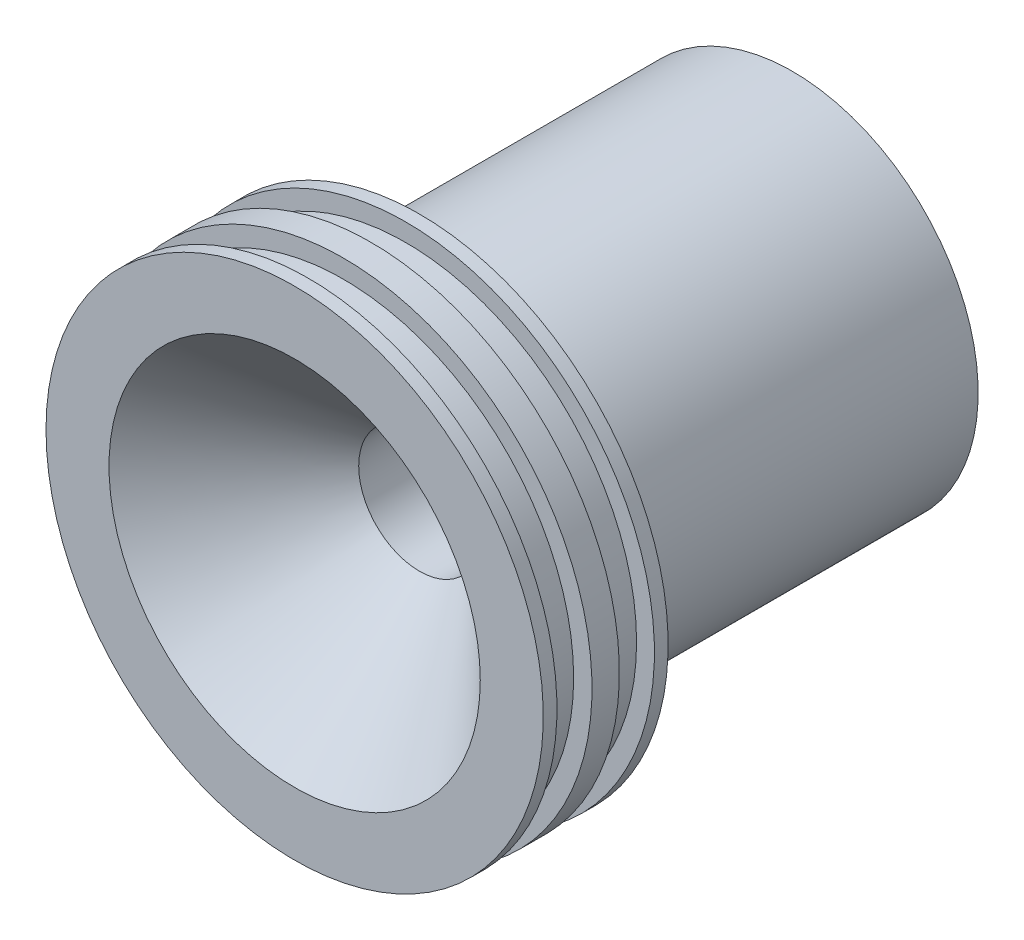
ISO-10303-21;
HEADER;
FILE_DESCRIPTION(('STEP AP214'),'2;1');
FILE_NAME('part.step','',(''),(''),'','','');
FILE_SCHEMA(('AUTOMOTIVE_DESIGN { 1 0 10303 214 1 1 1 1 }'));
ENDSEC;
DATA;
#1=APPLICATION_CONTEXT('core data for automotive mechanical design processes');
#2=APPLICATION_PROTOCOL_DEFINITION('international standard','automotive_design',2000,#1);
#3=PRODUCT_CONTEXT('',#1,'mechanical');
#4=PRODUCT('Part','Part','',(#3));
#5=PRODUCT_RELATED_PRODUCT_CATEGORY('part','',(#4));
#6=PRODUCT_DEFINITION_FORMATION('','',#4);
#7=PRODUCT_DEFINITION_CONTEXT('part definition',#1,'design');
#8=PRODUCT_DEFINITION('design','',#6,#7);
#9=PRODUCT_DEFINITION_SHAPE('','',#8);
#10=(LENGTH_UNIT() NAMED_UNIT(*) SI_UNIT(.MILLI.,.METRE.));
#11=(NAMED_UNIT(*) PLANE_ANGLE_UNIT() SI_UNIT($,.RADIAN.));
#12=(NAMED_UNIT(*) SI_UNIT($,.STERADIAN.) SOLID_ANGLE_UNIT());
#13=UNCERTAINTY_MEASURE_WITH_UNIT(LENGTH_MEASURE(1.E-05),#10,'distance_accuracy_value','');
#14=(GEOMETRIC_REPRESENTATION_CONTEXT(3) GLOBAL_UNCERTAINTY_ASSIGNED_CONTEXT((#13)) GLOBAL_UNIT_ASSIGNED_CONTEXT((#10,
#11,#12)) REPRESENTATION_CONTEXT('',''));
#15=CARTESIAN_POINT('',(0.,0.,0.));
#16=DIRECTION('',(0.,0.,1.));
#17=DIRECTION('',(1.,0.,0.));
#18=AXIS2_PLACEMENT_3D('',#15,#16,#17);
#19=CARTESIAN_POINT('',(0.,0.,-87.4649220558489));
#20=DIRECTION('',(0.,0.,-1.));
#21=DIRECTION('',(-1.,0.,0.));
#22=AXIS2_PLACEMENT_3D('',#19,#20,#21);
#23=CYLINDRICAL_SURFACE('',#22,37.846);
#24=CARTESIAN_POINT('',(0.,0.,18.8529595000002));
#25=DIRECTION('',(0.,0.,-1.));
#26=DIRECTION('',(-1.,0.,0.));
#27=AXIS2_PLACEMENT_3D('',#24,#25,#26);
#28=CIRCLE('',#27,37.846);
#29=CARTESIAN_POINT('',(-37.846,0.,18.8529595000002));
#30=VERTEX_POINT('',#29);
#31=EDGE_CURVE('E109',#30,#30,#28,.T.);
#32=ORIENTED_EDGE('',*,*,#31,.T.);
#33=EDGE_LOOP('',(#32));
#34=FACE_BOUND('',#33,.T.);
#35=CARTESIAN_POINT('',(0.,0.,14.6849465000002));
#36=DIRECTION('',(0.,0.,-1.));
#37=DIRECTION('',(-1.,0.,0.));
#38=AXIS2_PLACEMENT_3D('',#35,#36,#37);
#39=CIRCLE('',#38,37.846);
#40=CARTESIAN_POINT('',(-37.846,0.,14.6849465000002));
#41=VERTEX_POINT('',#40);
#42=EDGE_CURVE('E10',#41,#41,#39,.T.);
#43=ORIENTED_EDGE('',*,*,#42,.F.);
#44=EDGE_LOOP('',(#43));
#45=FACE_BOUND('',#44,.T.);
#46=ADVANCED_FACE('F42',(#34,#45),#23,.T.);
#47=CARTESIAN_POINT('',(0.,37.846,14.6849465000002));
#48=DIRECTION('',(0.,0.,-1.));
#49=DIRECTION('',(-1.,0.,0.));
#50=AXIS2_PLACEMENT_3D('',#47,#48,#49);
#51=PLANE('',#50);
#52=ORIENTED_EDGE('',*,*,#42,.T.);
#53=EDGE_LOOP('',(#52));
#54=FACE_BOUND('',#53,.T.);
#55=CARTESIAN_POINT('',(0.,0.,14.6849465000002));
#56=DIRECTION('',(0.,0.,-1.));
#57=DIRECTION('',(-1.,0.,0.));
#58=AXIS2_PLACEMENT_3D('',#55,#56,#57);
#59=CIRCLE('',#58,35.1282);
#60=CARTESIAN_POINT('',(-35.1282,0.,14.6849465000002));
#61=VERTEX_POINT('',#60);
#62=EDGE_CURVE('E49',#61,#61,#59,.T.);
#63=ORIENTED_EDGE('',*,*,#62,.F.);
#64=EDGE_LOOP('',(#63));
#65=FACE_BOUND('',#64,.T.);
#66=ADVANCED_FACE('F128',(#54,#65),#51,.T.);
#67=CARTESIAN_POINT('',(0.,0.,-87.4649220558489));
#68=DIRECTION('',(0.,0.,-1.));
#69=DIRECTION('',(-1.,0.,0.));
#70=AXIS2_PLACEMENT_3D('',#67,#68,#69);
#71=CYLINDRICAL_SURFACE('',#70,35.1282);
#72=ORIENTED_EDGE('',*,*,#62,.T.);
#73=EDGE_LOOP('',(#72));
#74=FACE_BOUND('',#73,.T.);
#75=CARTESIAN_POINT('',(0.,0.,9.35094650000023));
#76=DIRECTION('',(0.,0.,-1.));
#77=DIRECTION('',(-1.,0.,0.));
#78=AXIS2_PLACEMENT_3D('',#75,#76,#77);
#79=CIRCLE('',#78,35.1282);
#80=CARTESIAN_POINT('',(-35.1282,0.,9.35094650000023));
#81=VERTEX_POINT('',#80);
#82=EDGE_CURVE('E54',#81,#81,#79,.T.);
#83=ORIENTED_EDGE('',*,*,#82,.F.);
#84=EDGE_LOOP('',(#83));
#85=FACE_BOUND('',#84,.T.);
#86=ADVANCED_FACE('F132',(#74,#85),#71,.T.);
#87=CARTESIAN_POINT('',(0.,35.1282,9.35094650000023));
#88=DIRECTION('',(0.,0.,1.));
#89=DIRECTION('',(1.,0.,0.));
#90=AXIS2_PLACEMENT_3D('',#87,#88,#89);
#91=PLANE('',#90);
#92=ORIENTED_EDGE('',*,*,#82,.T.);
#93=EDGE_LOOP('',(#92));
#94=FACE_BOUND('',#93,.T.);
#95=CARTESIAN_POINT('',(0.,0.,9.35094650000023));
#96=DIRECTION('',(0.,0.,-1.));
#97=DIRECTION('',(-1.,0.,0.));
#98=AXIS2_PLACEMENT_3D('',#95,#96,#97);
#99=CIRCLE('',#98,37.846);
#100=CARTESIAN_POINT('',(-37.846,0.,9.35094650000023));
#101=VERTEX_POINT('',#100);
#102=EDGE_CURVE('E59',#101,#101,#99,.T.);
#103=ORIENTED_EDGE('',*,*,#102,.F.);
#104=EDGE_LOOP('',(#103));
#105=FACE_BOUND('',#104,.T.);
#106=ADVANCED_FACE('F136',(#94,#105),#91,.T.);
#107=CARTESIAN_POINT('',(0.,0.,-87.4649220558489));
#108=DIRECTION('',(0.,0.,-1.));
#109=DIRECTION('',(-1.,0.,0.));
#110=AXIS2_PLACEMENT_3D('',#107,#108,#109);
#111=CYLINDRICAL_SURFACE('',#110,37.846);
#112=ORIENTED_EDGE('',*,*,#102,.T.);
#113=EDGE_LOOP('',(#112));
#114=FACE_BOUND('',#113,.T.);
#115=CARTESIAN_POINT('',(0.,0.,7.26694000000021));
#116=DIRECTION('',(0.,0.,-1.));
#117=DIRECTION('',(-1.,0.,0.));
#118=AXIS2_PLACEMENT_3D('',#115,#116,#117);
#119=CIRCLE('',#118,37.846);
#120=CARTESIAN_POINT('',(-37.846,0.,7.26694000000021));
#121=VERTEX_POINT('',#120);
#122=EDGE_CURVE('E65',#121,#121,#119,.T.);
#123=ORIENTED_EDGE('',*,*,#122,.F.);
#124=EDGE_LOOP('',(#123));
#125=FACE_BOUND('',#124,.T.);
#126=ADVANCED_FACE('F142',(#114,#125),#111,.T.);
#127=CARTESIAN_POINT('',(0.,28.2575,7.26694000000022));
#128=DIRECTION('',(0.,0.,-1.));
#129=DIRECTION('',(-1.,0.,0.));
#130=AXIS2_PLACEMENT_3D('',#127,#128,#129);
#131=PLANE('',#130);
#132=ORIENTED_EDGE('',*,*,#122,.T.);
#133=EDGE_LOOP('',(#132));
#134=FACE_BOUND('',#133,.T.);
#135=CARTESIAN_POINT('',(0.,0.,7.26694000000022));
#136=DIRECTION('',(0.,0.,-1.));
#137=DIRECTION('',(-1.,0.,0.));
#138=AXIS2_PLACEMENT_3D('',#135,#136,#137);
#139=CIRCLE('',#138,28.2575);
#140=CARTESIAN_POINT('',(-28.2575,0.,7.26694000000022));
#141=VERTEX_POINT('',#140);
#142=EDGE_CURVE('E69',#141,#141,#139,.T.);
#143=ORIENTED_EDGE('',*,*,#142,.F.);
#144=EDGE_LOOP('',(#143));
#145=FACE_BOUND('',#144,.T.);
#146=ADVANCED_FACE('F146',(#134,#145),#131,.T.);
#147=CARTESIAN_POINT('',(0.,0.,-87.4649220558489));
#148=DIRECTION('',(0.,0.,-1.));
#149=DIRECTION('',(-1.,0.,0.));
#150=AXIS2_PLACEMENT_3D('',#147,#148,#149);
#151=CYLINDRICAL_SURFACE('',#150,28.2575);
#152=ORIENTED_EDGE('',*,*,#142,.T.);
#153=EDGE_LOOP('',(#152));
#154=FACE_BOUND('',#153,.T.);
#155=CARTESIAN_POINT('',(0.,0.,-49.5157182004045));
#156=DIRECTION('',(0.,0.,-1.));
#157=DIRECTION('',(-1.,0.,0.));
#158=AXIS2_PLACEMENT_3D('',#155,#156,#157);
#159=CIRCLE('',#158,28.2575);
#160=CARTESIAN_POINT('',(-28.2575,0.,-49.5157182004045));
#161=VERTEX_POINT('',#160);
#162=EDGE_CURVE('E73',#161,#161,#159,.T.);
#163=ORIENTED_EDGE('',*,*,#162,.F.);
#164=EDGE_LOOP('',(#163));
#165=FACE_BOUND('',#164,.T.);
#166=ADVANCED_FACE('F150',(#154,#165),#151,.T.);
#167=CARTESIAN_POINT('',(0.,20.574,-49.5157182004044));
#168=DIRECTION('',(0.,0.,-1.));
#169=DIRECTION('',(-1.,0.,0.));
#170=AXIS2_PLACEMENT_3D('',#167,#168,#169);
#171=PLANE('',#170);
#172=ORIENTED_EDGE('',*,*,#162,.T.);
#173=EDGE_LOOP('',(#172));
#174=FACE_BOUND('',#173,.T.);
#175=CARTESIAN_POINT('',(0.,0.,-49.5157182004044));
#176=DIRECTION('',(0.,0.,-1.));
#177=DIRECTION('',(-1.,0.,0.));
#178=AXIS2_PLACEMENT_3D('',#175,#176,#177);
#179=CIRCLE('',#178,20.574);
#180=CARTESIAN_POINT('',(-20.574,0.,-49.5157182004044));
#181=VERTEX_POINT('',#180);
#182=EDGE_CURVE('E77',#181,#181,#179,.T.);
#183=ORIENTED_EDGE('',*,*,#182,.F.);
#184=EDGE_LOOP('',(#183));
#185=FACE_BOUND('',#184,.T.);
#186=ADVANCED_FACE('F154',(#174,#185),#171,.T.);
#187=CARTESIAN_POINT('',(0.,0.,-7.26694));
#188=DIRECTION('',(0.,0.,-1.));
#189=DIRECTION('',(-1.,0.,0.));
#190=AXIS2_PLACEMENT_3D('',#187,#188,#189);
#191=CONICAL_SURFACE('',#190,9.25347399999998,0.26179938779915);
#192=ORIENTED_EDGE('',*,*,#182,.T.);
#193=EDGE_LOOP('',(#192));
#194=FACE_BOUND('',#193,.T.);
#195=CARTESIAN_POINT('',(0.,0.,-7.26694));
#196=DIRECTION('',(0.,0.,-1.));
#197=DIRECTION('',(-1.,0.,0.));
#198=AXIS2_PLACEMENT_3D('',#195,#196,#197);
#199=CIRCLE('',#198,9.25347399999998);
#200=CARTESIAN_POINT('',(-9.25347399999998,0.,-7.26694));
#201=VERTEX_POINT('',#200);
#202=EDGE_CURVE('E81',#201,#201,#199,.T.);
#203=ORIENTED_EDGE('',*,*,#202,.F.);
#204=EDGE_LOOP('',(#203));
#205=FACE_BOUND('',#204,.T.);
#206=ADVANCED_FACE('F158',(#194,#205),#191,.F.);
#207=CARTESIAN_POINT('',(0.,0.,-87.4649220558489));
#208=DIRECTION('',(0.,0.,-1.));
#209=DIRECTION('',(-1.,0.,0.));
#210=AXIS2_PLACEMENT_3D('',#207,#208,#209);
#211=CYLINDRICAL_SURFACE('',#210,9.25347399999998);
#212=ORIENTED_EDGE('',*,*,#202,.T.);
#213=EDGE_LOOP('',(#212));
#214=FACE_BOUND('',#213,.T.);
#215=CARTESIAN_POINT('',(0.,0.,7.26694));
#216=DIRECTION('',(0.,0.,-1.));
#217=DIRECTION('',(-1.,0.,0.));
#218=AXIS2_PLACEMENT_3D('',#215,#216,#217);
#219=CIRCLE('',#218,9.25347399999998);
#220=CARTESIAN_POINT('',(9.25347399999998,0.,7.26694));
#221=VERTEX_POINT('',#220);
#222=EDGE_CURVE('E85',#221,#221,#219,.T.);
#223=ORIENTED_EDGE('',*,*,#222,.F.);
#224=EDGE_LOOP('',(#223));
#225=FACE_BOUND('',#224,.T.);
#226=ADVANCED_FACE('F162',(#214,#225),#211,.F.);
#227=CARTESIAN_POINT('',(0.,0.,26.2709660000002));
#228=DIRECTION('',(0.,0.,1.));
#229=DIRECTION('',(1.,0.,0.));
#230=AXIS2_PLACEMENT_3D('',#227,#228,#229);
#231=CONICAL_SURFACE('',#230,28.2575,0.785398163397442);
#232=CARTESIAN_POINT('',(0.,0.,26.2709660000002));
#233=DIRECTION('',(0.,0.,-1.));
#234=DIRECTION('',(-1.,0.,0.));
#235=AXIS2_PLACEMENT_3D('',#232,#233,#234);
#236=CIRCLE('',#235,28.2575);
#237=CARTESIAN_POINT('',(28.2575,0.,26.2709660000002));
#238=VERTEX_POINT('',#237);
#239=EDGE_CURVE('E89',#238,#238,#236,.T.);
#240=CARTESIAN_POINT('',(9.25347399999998,0.,7.26694));
#241=CARTESIAN_POINT('',(9.45143260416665,0.,7.46489860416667));
#242=CARTESIAN_POINT('',(9.64939120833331,0.,7.66285720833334));
#243=CARTESIAN_POINT('',(10.0453084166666,0.,8.05877441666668));
#244=CARTESIAN_POINT('',(10.2432670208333,0.,8.25673302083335));
#245=CARTESIAN_POINT('',(10.6391842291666,0.,8.65265022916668));
#246=CARTESIAN_POINT('',(10.8371428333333,0.,8.85060883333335));
#247=CARTESIAN_POINT('',(11.2330600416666,0.,9.24652604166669));
#248=CARTESIAN_POINT('',(11.4310186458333,0.,9.44448464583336));
#249=CARTESIAN_POINT('',(11.8269358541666,0.,9.8404018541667));
#250=CARTESIAN_POINT('',(12.0248944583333,0.,10.0383604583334));
#251=CARTESIAN_POINT('',(12.4208116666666,0.,10.4342776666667));
#252=CARTESIAN_POINT('',(12.6187702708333,0.,10.6322362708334));
#253=CARTESIAN_POINT('',(13.0146874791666,0.,11.0281534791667));
#254=CARTESIAN_POINT('',(13.2126460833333,0.,11.2261120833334));
#255=CARTESIAN_POINT('',(13.6085632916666,0.,11.6220292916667));
#256=CARTESIAN_POINT('',(13.8065218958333,0.,11.8199878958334));
#257=CARTESIAN_POINT('',(14.2024391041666,0.,12.2159051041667));
#258=CARTESIAN_POINT('',(14.4003977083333,0.,12.4138637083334));
#259=CARTESIAN_POINT('',(14.7963149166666,0.,12.8097809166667));
#260=CARTESIAN_POINT('',(14.9942735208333,0.,13.0077395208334));
#261=CARTESIAN_POINT('',(15.3901907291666,0.,13.4036567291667));
#262=CARTESIAN_POINT('',(15.5881493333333,0.,13.6016153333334));
#263=CARTESIAN_POINT('',(15.9840665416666,0.,13.9975325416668));
#264=CARTESIAN_POINT('',(16.1820251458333,0.,14.1954911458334));
#265=CARTESIAN_POINT('',(16.5779423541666,0.,14.5914083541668));
#266=CARTESIAN_POINT('',(16.7759009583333,0.,14.7893669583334));
#267=CARTESIAN_POINT('',(17.1718181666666,0.,15.1852841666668));
#268=CARTESIAN_POINT('',(17.3697767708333,0.,15.3832427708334));
#269=CARTESIAN_POINT('',(17.7656939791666,0.,15.7791599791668));
#270=CARTESIAN_POINT('',(17.9636525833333,0.,15.9771185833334));
#271=CARTESIAN_POINT('',(18.3595697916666,0.,16.3730357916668));
#272=CARTESIAN_POINT('',(18.5575283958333,0.,16.5709943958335));
#273=CARTESIAN_POINT('',(18.9534456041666,0.,16.9669116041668));
#274=CARTESIAN_POINT('',(19.1514042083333,0.,17.1648702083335));
#275=CARTESIAN_POINT('',(19.5473214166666,0.,17.5607874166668));
#276=CARTESIAN_POINT('',(19.7452800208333,0.,17.7587460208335));
#277=CARTESIAN_POINT('',(20.1411972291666,0.,18.1546632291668));
#278=CARTESIAN_POINT('',(20.3391558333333,0.,18.3526218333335));
#279=CARTESIAN_POINT('',(20.7350730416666,0.,18.7485390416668));
#280=CARTESIAN_POINT('',(20.9330316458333,0.,18.9464976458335));
#281=CARTESIAN_POINT('',(21.3289488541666,0.,19.3424148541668));
#282=CARTESIAN_POINT('',(21.5269074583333,0.,19.5403734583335));
#283=CARTESIAN_POINT('',(21.9228246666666,0.,19.9362906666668));
#284=CARTESIAN_POINT('',(22.1207832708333,0.,20.1342492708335));
#285=CARTESIAN_POINT('',(22.5167004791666,0.,20.5301664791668));
#286=CARTESIAN_POINT('',(22.7146590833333,0.,20.7281250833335));
#287=CARTESIAN_POINT('',(23.1105762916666,0.,21.1240422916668));
#288=CARTESIAN_POINT('',(23.3085348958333,0.,21.3220008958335));
#289=CARTESIAN_POINT('',(23.7044521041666,0.,21.7179181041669));
#290=CARTESIAN_POINT('',(23.9024107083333,0.,21.9158767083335));
#291=CARTESIAN_POINT('',(24.2983279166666,0.,22.3117939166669));
#292=CARTESIAN_POINT('',(24.4962865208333,0.,22.5097525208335));
#293=CARTESIAN_POINT('',(24.8922037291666,0.,22.9056697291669));
#294=CARTESIAN_POINT('',(25.0901623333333,0.,23.1036283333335));
#295=CARTESIAN_POINT('',(25.4860795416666,0.,23.4995455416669));
#296=CARTESIAN_POINT('',(25.6840381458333,0.,23.6975041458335));
#297=CARTESIAN_POINT('',(26.0799553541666,0.,24.0934213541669));
#298=CARTESIAN_POINT('',(26.2779139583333,0.,24.2913799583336));
#299=CARTESIAN_POINT('',(26.6738311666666,0.,24.6872971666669));
#300=CARTESIAN_POINT('',(26.8717897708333,0.,24.8852557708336));
#301=CARTESIAN_POINT('',(27.2677069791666,0.,25.2811729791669));
#302=CARTESIAN_POINT('',(27.4656655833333,0.,25.4791315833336));
#303=CARTESIAN_POINT('',(27.8615827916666,0.,25.8750487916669));
#304=CARTESIAN_POINT('',(28.0595413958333,0.,26.0730073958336));
#305=CARTESIAN_POINT('',(28.2575,0.,26.2709660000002));
#306=B_SPLINE_CURVE_WITH_KNOTS('',3,(#240,#241,#242,#243,#244,#245,#246,#247,#248,#249,#250,
#251,#252,#253,#254,#255,#256,#257,#258,#259,#260,#261,#262,#263,#264,#265,#266,#267,#268,#269,
#270,#271,#272,#273,#274,#275,#276,#277,#278,#279,#280,#281,#282,#283,#284,#285,#286,#287,#288,
#289,#290,#291,#292,#293,#294,#295,#296,#297,#298,#299,#300,#301,#302,#303,#304,#305),
.UNSPECIFIED.,.F.,.F.,(4,2,2,2,2,2,2,2,2,2,2,2,2,2,2,2,2,2,2,2,2,2,2,2,2,2,2,2,2,2,2,2,4),(0.,
0.839867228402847,1.67973445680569,2.51960168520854,3.35946891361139,4.19933614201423,
5.03920337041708,5.87907059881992,6.71893782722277,7.55880505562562,8.39867228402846,
9.23853951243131,10.0784067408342,10.918273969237,11.7581411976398,12.5980084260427,
13.4378756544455,14.2777428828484,15.1176101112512,15.9574773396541,16.7973445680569,
17.6372117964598,18.4770790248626,19.3169462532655,20.1568134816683,20.9966807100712,
21.836547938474,22.6764151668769,23.5162823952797,24.3561496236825,25.1960168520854,
26.0358840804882,26.8757513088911),.UNSPECIFIED.);
#307=EDGE_CURVE('BSEAM166',#221,#238,#306,.T.);
#308=ORIENTED_EDGE('',*,*,#222,.T.);
#309=ORIENTED_EDGE('',*,*,#239,.F.);
#310=ORIENTED_EDGE('',*,*,#307,.T.);
#311=ORIENTED_EDGE('',*,*,#307,.F.);
#312=EDGE_LOOP('',(#308,#310,#309,#311));
#313=FACE_BOUND('',#312,.T.);
#314=ADVANCED_FACE('F166',(#313),#231,.F.);
#315=CARTESIAN_POINT('',(0.,37.846,26.2709660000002));
#316=DIRECTION('',(0.,0.,1.));
#317=DIRECTION('',(1.,0.,0.));
#318=AXIS2_PLACEMENT_3D('',#315,#316,#317);
#319=PLANE('',#318);
#320=ORIENTED_EDGE('',*,*,#239,.T.);
#321=EDGE_LOOP('',(#320));
#322=FACE_BOUND('',#321,.T.);
#323=CARTESIAN_POINT('',(0.,0.,26.2709660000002));
#324=DIRECTION('',(0.,0.,-1.));
#325=DIRECTION('',(-1.,0.,0.));
#326=AXIS2_PLACEMENT_3D('',#323,#324,#325);
#327=CIRCLE('',#326,37.846);
#328=CARTESIAN_POINT('',(-37.846,0.,26.2709660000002));
#329=VERTEX_POINT('',#328);
#330=EDGE_CURVE('E93',#329,#329,#327,.T.);
#331=ORIENTED_EDGE('',*,*,#330,.F.);
#332=EDGE_LOOP('',(#331));
#333=FACE_BOUND('',#332,.T.);
#334=ADVANCED_FACE('F170',(#322,#333),#319,.T.);
#335=CARTESIAN_POINT('',(0.,0.,-87.4649220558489));
#336=DIRECTION('',(0.,0.,-1.));
#337=DIRECTION('',(-1.,0.,0.));
#338=AXIS2_PLACEMENT_3D('',#335,#336,#337);
#339=CYLINDRICAL_SURFACE('',#338,37.846);
#340=ORIENTED_EDGE('',*,*,#330,.T.);
#341=EDGE_LOOP('',(#340));
#342=FACE_BOUND('',#341,.T.);
#343=CARTESIAN_POINT('',(0.,0.,24.1869595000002));
#344=DIRECTION('',(0.,0.,-1.));
#345=DIRECTION('',(-1.,0.,0.));
#346=AXIS2_PLACEMENT_3D('',#343,#344,#345);
#347=CIRCLE('',#346,37.846);
#348=CARTESIAN_POINT('',(-37.846,0.,24.1869595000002));
#349=VERTEX_POINT('',#348);
#350=EDGE_CURVE('E97',#349,#349,#347,.T.);
#351=ORIENTED_EDGE('',*,*,#350,.F.);
#352=EDGE_LOOP('',(#351));
#353=FACE_BOUND('',#352,.T.);
#354=ADVANCED_FACE('F174',(#342,#353),#339,.T.);
#355=CARTESIAN_POINT('',(0.,37.846,24.1869595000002));
#356=DIRECTION('',(0.,0.,-1.));
#357=DIRECTION('',(-1.,0.,0.));
#358=AXIS2_PLACEMENT_3D('',#355,#356,#357);
#359=PLANE('',#358);
#360=ORIENTED_EDGE('',*,*,#350,.T.);
#361=EDGE_LOOP('',(#360));
#362=FACE_BOUND('',#361,.T.);
#363=CARTESIAN_POINT('',(0.,0.,24.1869595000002));
#364=DIRECTION('',(0.,0.,-1.));
#365=DIRECTION('',(-1.,0.,0.));
#366=AXIS2_PLACEMENT_3D('',#363,#364,#365);
#367=CIRCLE('',#366,35.052);
#368=CARTESIAN_POINT('',(-35.052,0.,24.1869595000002));
#369=VERTEX_POINT('',#368);
#370=EDGE_CURVE('E101',#369,#369,#367,.T.);
#371=ORIENTED_EDGE('',*,*,#370,.F.);
#372=EDGE_LOOP('',(#371));
#373=FACE_BOUND('',#372,.T.);
#374=ADVANCED_FACE('F124',(#362,#373),#359,.T.);
#375=CARTESIAN_POINT('',(0.,0.,-87.4649220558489));
#376=DIRECTION('',(0.,0.,-1.));
#377=DIRECTION('',(-1.,0.,0.));
#378=AXIS2_PLACEMENT_3D('',#375,#376,#377);
#379=CYLINDRICAL_SURFACE('',#378,35.052);
#380=ORIENTED_EDGE('',*,*,#370,.T.);
#381=EDGE_LOOP('',(#380));
#382=FACE_BOUND('',#381,.T.);
#383=CARTESIAN_POINT('',(0.,0.,18.8529595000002));
#384=DIRECTION('',(0.,0.,-1.));
#385=DIRECTION('',(-1.,0.,0.));
#386=AXIS2_PLACEMENT_3D('',#383,#384,#385);
#387=CIRCLE('',#386,35.052);
#388=CARTESIAN_POINT('',(-35.052,0.,18.8529595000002));
#389=VERTEX_POINT('',#388);
#390=EDGE_CURVE('E105',#389,#389,#387,.T.);
#391=ORIENTED_EDGE('',*,*,#390,.F.);
#392=EDGE_LOOP('',(#391));
#393=FACE_BOUND('',#392,.T.);
#394=ADVANCED_FACE('F118',(#382,#393),#379,.T.);
#395=CARTESIAN_POINT('',(0.,35.052,18.8529595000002));
#396=DIRECTION('',(0.,0.,1.));
#397=DIRECTION('',(1.,0.,0.));
#398=AXIS2_PLACEMENT_3D('',#395,#396,#397);
#399=PLANE('',#398);
#400=ORIENTED_EDGE('',*,*,#390,.T.);
#401=EDGE_LOOP('',(#400));
#402=FACE_BOUND('',#401,.T.);
#403=ORIENTED_EDGE('',*,*,#31,.F.);
#404=EDGE_LOOP('',(#403));
#405=FACE_BOUND('',#404,.T.);
#406=ADVANCED_FACE('F116',(#402,#405),#399,.T.);
#407=CLOSED_SHELL('',(#46,#66,#86,#106,#126,#146,#166,#186,#206,#226,#314,#334,#354,#374,#394,#406));
#408=MANIFOLD_SOLID_BREP('B2',#407);
#409=ADVANCED_BREP_SHAPE_REPRESENTATION('',(#18,#408),#14);
#410=SHAPE_DEFINITION_REPRESENTATION(#9,#409);
ENDSEC;
END-ISO-10303-21;
